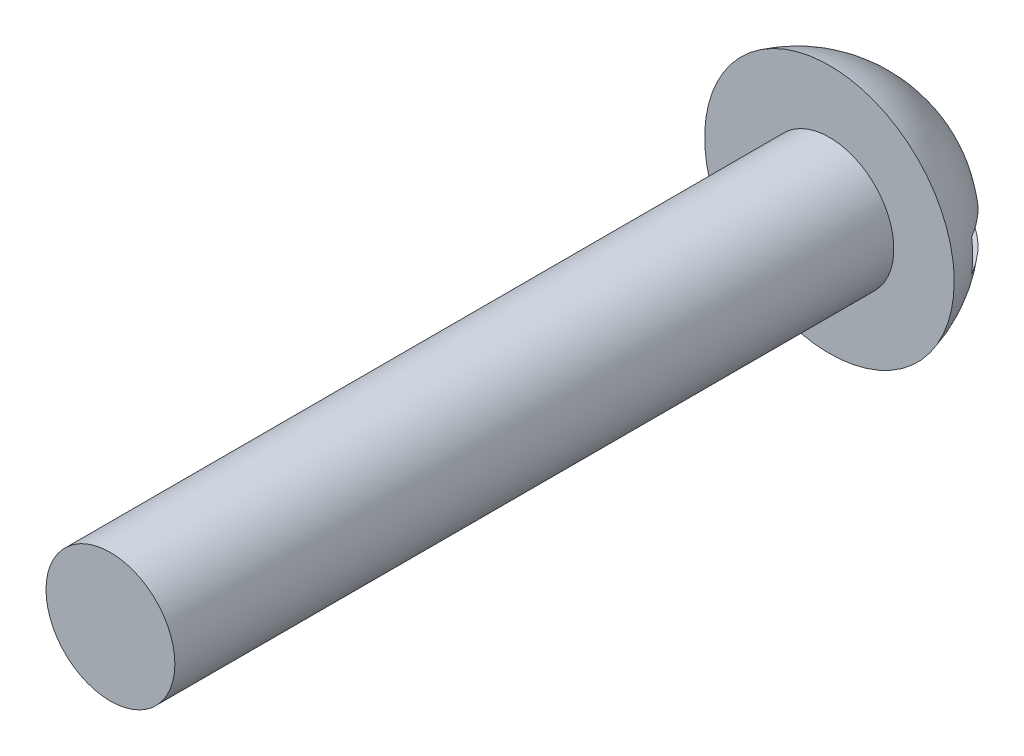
ISO-10303-21;
HEADER;
FILE_DESCRIPTION(('STEP AP214'),'2;1');
FILE_NAME('part.step','',(''),(''),'','','');
FILE_SCHEMA(('AUTOMOTIVE_DESIGN { 1 0 10303 214 1 1 1 1 }'));
ENDSEC;
DATA;
#1=APPLICATION_CONTEXT('core data for automotive mechanical design processes');
#2=APPLICATION_PROTOCOL_DEFINITION('international standard','automotive_design',2000,#1);
#3=PRODUCT_CONTEXT('',#1,'mechanical');
#4=PRODUCT('Part','Part','',(#3));
#5=PRODUCT_RELATED_PRODUCT_CATEGORY('part','',(#4));
#6=PRODUCT_DEFINITION_FORMATION('','',#4);
#7=PRODUCT_DEFINITION_CONTEXT('part definition',#1,'design');
#8=PRODUCT_DEFINITION('design','',#6,#7);
#9=PRODUCT_DEFINITION_SHAPE('','',#8);
#10=(LENGTH_UNIT() NAMED_UNIT(*) SI_UNIT(.MILLI.,.METRE.));
#11=(NAMED_UNIT(*) PLANE_ANGLE_UNIT() SI_UNIT($,.RADIAN.));
#12=(NAMED_UNIT(*) SI_UNIT($,.STERADIAN.) SOLID_ANGLE_UNIT());
#13=UNCERTAINTY_MEASURE_WITH_UNIT(LENGTH_MEASURE(1.E-05),#10,'distance_accuracy_value','');
#14=(GEOMETRIC_REPRESENTATION_CONTEXT(3) GLOBAL_UNCERTAINTY_ASSIGNED_CONTEXT((#13)) GLOBAL_UNIT_ASSIGNED_CONTEXT((#10,
#11,#12)) REPRESENTATION_CONTEXT('',''));
#15=CARTESIAN_POINT('',(0.,0.,0.));
#16=DIRECTION('',(0.,0.,1.));
#17=DIRECTION('',(1.,0.,0.));
#18=AXIS2_PLACEMENT_3D('',#15,#16,#17);
#19=CARTESIAN_POINT('',(0.,15.282157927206,23.5712));
#20=DIRECTION('',(0.,0.,1.));
#21=DIRECTION('',(0.,1.,0.));
#22=AXIS2_PLACEMENT_3D('',#19,#20,#21);
#23=SPHERICAL_SURFACE('',#22,2.8448);
#24=CARTESIAN_POINT('',(0.,15.282157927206,22.86));
#25=DIRECTION('',(0.,0.,1.));
#26=DIRECTION('',(1.,0.,0.));
#27=AXIS2_PLACEMENT_3D('',#24,#25,#26);
#28=CIRCLE('',#27,2.75446575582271);
#29=CARTESIAN_POINT('',(2.75446575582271,15.282157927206,22.86));
#30=VERTEX_POINT('',#29);
#31=EDGE_CURVE('E68',#30,#30,#28,.T.);
#32=ORIENTED_EDGE('',*,*,#31,.F.);
#33=EDGE_LOOP('',(#32));
#34=FACE_BOUND('',#33,.T.);
#35=CARTESIAN_POINT('',(0.,15.282157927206,22.1711125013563));
#36=DIRECTION('',(0.,0.,-1.));
#37=DIRECTION('',(-1.,0.,0.));
#38=AXIS2_PLACEMENT_3D('',#35,#36,#37);
#39=CIRCLE('',#38,2.47641717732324);
#40=CARTESIAN_POINT('',(2.4507530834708,15.637757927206,22.1711125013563));
#41=VERTEX_POINT('',#40);
#42=CARTESIAN_POINT('',(2.4507530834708,14.926557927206,22.1711125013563));
#43=VERTEX_POINT('',#42);
#44=EDGE_CURVE('E61',#41,#43,#39,.T.);
#45=ORIENTED_EDGE('',*,*,#44,.F.);
#46=CARTESIAN_POINT('',(0.,15.637757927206,23.5712));
#47=DIRECTION('',(0.,1.,0.));
#48=DIRECTION('',(0.,0.,1.));
#49=AXIS2_PLACEMENT_3D('',#46,#47,#48);
#50=CIRCLE('',#49,2.82248749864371);
#51=CARTESIAN_POINT('',(-2.4507530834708,15.637757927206,22.1711125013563));
#52=VERTEX_POINT('',#51);
#53=EDGE_CURVE('E74',#41,#52,#50,.T.);
#54=ORIENTED_EDGE('',*,*,#53,.T.);
#55=CARTESIAN_POINT('',(0.,15.282157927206,22.1711125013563));
#56=DIRECTION('',(0.,0.,1.));
#57=DIRECTION('',(1.,0.,0.));
#58=AXIS2_PLACEMENT_3D('',#55,#56,#57);
#59=CIRCLE('',#58,2.47641717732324);
#60=CARTESIAN_POINT('',(-2.4507530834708,14.926557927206,22.1711125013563));
#61=VERTEX_POINT('',#60);
#62=EDGE_CURVE('E36',#52,#61,#59,.T.);
#63=ORIENTED_EDGE('',*,*,#62,.T.);
#64=CARTESIAN_POINT('',(0.,14.926557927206,23.5712));
#65=DIRECTION('',(0.,-1.,0.));
#66=DIRECTION('',(0.,0.,-1.));
#67=AXIS2_PLACEMENT_3D('',#64,#65,#66);
#68=CIRCLE('',#67,2.82248749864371);
#69=EDGE_CURVE('E11',#61,#43,#68,.T.);
#70=ORIENTED_EDGE('',*,*,#69,.T.);
#71=EDGE_LOOP('',(#45,#54,#63,#70));
#72=FACE_BOUND('',#71,.T.);
#73=ADVANCED_FACE('F28',(#34,#72),#23,.T.);
#74=CARTESIAN_POINT('',(0.,18.0366236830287,22.86));
#75=DIRECTION('',(0.,0.,-1.));
#76=DIRECTION('',(-1.,0.,0.));
#77=AXIS2_PLACEMENT_3D('',#74,#75,#76);
#78=PLANE('',#77);
#79=ORIENTED_EDGE('',*,*,#31,.T.);
#80=EDGE_LOOP('',(#79));
#81=FACE_BOUND('',#80,.T.);
#82=CARTESIAN_POINT('',(0.,15.24,22.86));
#83=DIRECTION('',(0.,0.,-1.));
#84=DIRECTION('',(-1.,0.,0.));
#85=AXIS2_PLACEMENT_3D('',#82,#83,#84);
#86=CIRCLE('',#85,1.4224);
#87=CARTESIAN_POINT('',(-1.4224,15.24,22.86));
#88=VERTEX_POINT('',#87);
#89=EDGE_CURVE('E71',#88,#88,#86,.F.);
#90=ORIENTED_EDGE('',*,*,#89,.F.);
#91=EDGE_LOOP('',(#90));
#92=FACE_BOUND('',#91,.T.);
#93=ADVANCED_FACE('F30',(#81,#92),#78,.F.);
#94=CARTESIAN_POINT('',(0.,15.24,38.735));
#95=DIRECTION('',(0.,0.,-1.));
#96=DIRECTION('',(-1.,0.,0.));
#97=AXIS2_PLACEMENT_3D('',#94,#95,#96);
#98=CYLINDRICAL_SURFACE('',#97,1.4224);
#99=CARTESIAN_POINT('',(0.,15.24,38.735));
#100=DIRECTION('',(0.,0.,1.));
#101=DIRECTION('',(1.,0.,0.));
#102=AXIS2_PLACEMENT_3D('',#99,#100,#101);
#103=CIRCLE('',#102,1.4224);
#104=CARTESIAN_POINT('',(1.4224,15.24,38.735));
#105=VERTEX_POINT('',#104);
#106=EDGE_CURVE('E55',#105,#105,#103,.T.);
#107=ORIENTED_EDGE('',*,*,#106,.F.);
#108=EDGE_LOOP('',(#107));
#109=FACE_BOUND('',#108,.T.);
#110=ORIENTED_EDGE('',*,*,#89,.T.);
#111=EDGE_LOOP('',(#110));
#112=FACE_BOUND('',#111,.T.);
#113=ADVANCED_FACE('F91',(#109,#112),#98,.T.);
#114=CARTESIAN_POINT('',(0.,15.24,38.735));
#115=DIRECTION('',(0.,0.,1.));
#116=DIRECTION('',(1.,0.,0.));
#117=AXIS2_PLACEMENT_3D('',#114,#115,#116);
#118=PLANE('',#117);
#119=ORIENTED_EDGE('',*,*,#106,.T.);
#120=EDGE_LOOP('',(#119));
#121=FACE_BOUND('',#120,.T.);
#122=ADVANCED_FACE('F96',(#121),#118,.T.);
#123=CARTESIAN_POINT('',(-2.75446575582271,14.926557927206,22.1711125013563));
#124=DIRECTION('',(0.,-1.,0.));
#125=DIRECTION('',(0.,0.,-1.));
#126=AXIS2_PLACEMENT_3D('',#123,#124,#125);
#127=PLANE('',#126);
#128=DIRECTION('',(1.,0.,0.));
#129=VECTOR('',#128,1.);
#130=CARTESIAN_POINT('',(-2.75446575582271,14.926557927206,22.1711125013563));
#131=LINE('',#130,#129);
#132=EDGE_CURVE('E52',#61,#43,#131,.T.);
#133=ORIENTED_EDGE('',*,*,#132,.T.);
#134=ORIENTED_EDGE('',*,*,#69,.F.);
#135=EDGE_LOOP('',(#133,#134));
#136=FACE_BOUND('',#135,.T.);
#137=ADVANCED_FACE('F53',(#136),#127,.F.);
#138=CARTESIAN_POINT('',(-2.75446575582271,15.637757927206,22.1711125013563));
#139=DIRECTION('',(0.,0.,1.));
#140=DIRECTION('',(1.,0.,0.));
#141=AXIS2_PLACEMENT_3D('',#138,#139,#140);
#142=PLANE('',#141);
#143=DIRECTION('',(1.,0.,0.));
#144=VECTOR('',#143,1.);
#145=CARTESIAN_POINT('',(-2.75446575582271,15.637757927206,22.1711125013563));
#146=LINE('',#145,#144);
#147=EDGE_CURVE('E56',#52,#41,#146,.T.);
#148=ORIENTED_EDGE('',*,*,#147,.T.);
#149=ORIENTED_EDGE('',*,*,#44,.T.);
#150=ORIENTED_EDGE('',*,*,#132,.F.);
#151=ORIENTED_EDGE('',*,*,#62,.F.);
#152=EDGE_LOOP('',(#148,#149,#150,#151));
#153=FACE_BOUND('',#152,.T.);
#154=ADVANCED_FACE('F62',(#153),#142,.F.);
#155=CARTESIAN_POINT('',(-2.75446575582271,15.637757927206,22.1711125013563));
#156=DIRECTION('',(0.,1.,0.));
#157=DIRECTION('',(0.,0.,1.));
#158=AXIS2_PLACEMENT_3D('',#155,#156,#157);
#159=PLANE('',#158);
#160=ORIENTED_EDGE('',*,*,#53,.F.);
#161=ORIENTED_EDGE('',*,*,#147,.F.);
#162=EDGE_LOOP('',(#160,#161));
#163=FACE_BOUND('',#162,.T.);
#164=ADVANCED_FACE('F76',(#163),#159,.F.);
#165=CLOSED_SHELL('',(#73,#93,#113,#122,#137,#154,#164));
#166=MANIFOLD_SOLID_BREP('B2',#165);
#167=ADVANCED_BREP_SHAPE_REPRESENTATION('',(#18,#166),#14);
#168=SHAPE_DEFINITION_REPRESENTATION(#9,#167);
ENDSEC;
END-ISO-10303-21;
